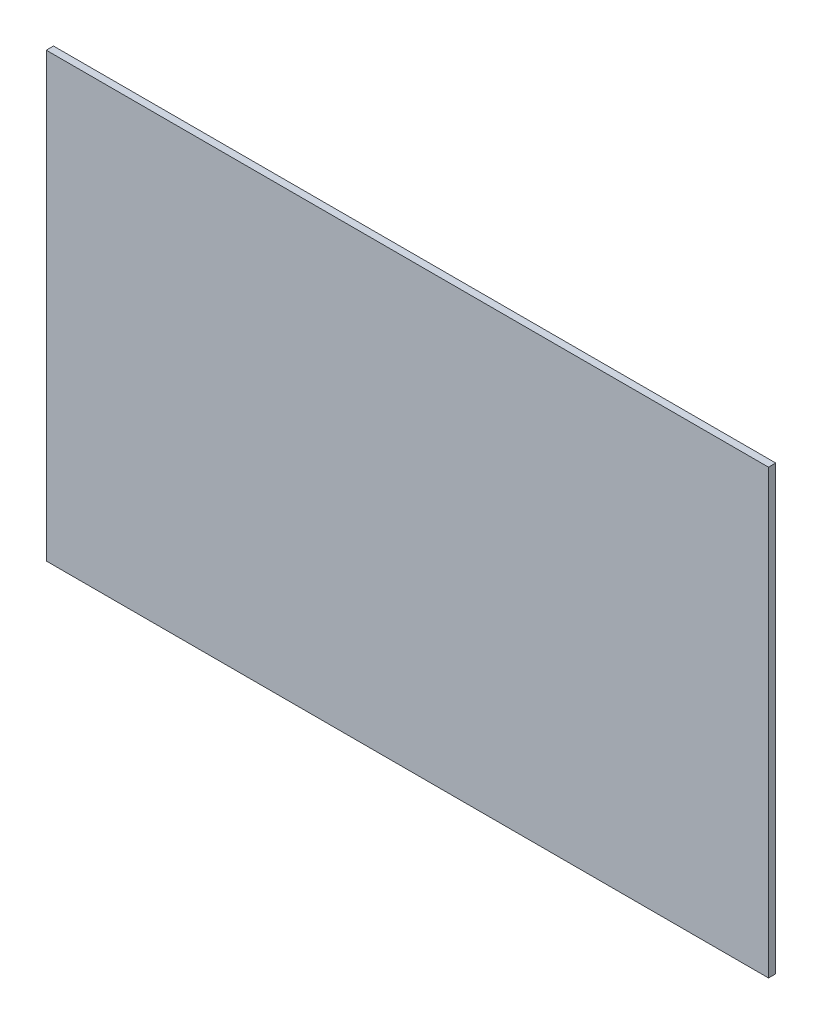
ISO-10303-21;
HEADER;
FILE_DESCRIPTION(('STEP AP214'),'2;1');
FILE_NAME('part.step','',(''),(''),'','','');
FILE_SCHEMA(('AUTOMOTIVE_DESIGN { 1 0 10303 214 1 1 1 1 }'));
ENDSEC;
DATA;
#1=APPLICATION_CONTEXT('core data for automotive mechanical design processes');
#2=APPLICATION_PROTOCOL_DEFINITION('international standard','automotive_design',2000,#1);
#3=PRODUCT_CONTEXT('',#1,'mechanical');
#4=PRODUCT('Part','Part','',(#3));
#5=PRODUCT_RELATED_PRODUCT_CATEGORY('part','',(#4));
#6=PRODUCT_DEFINITION_FORMATION('','',#4);
#7=PRODUCT_DEFINITION_CONTEXT('part definition',#1,'design');
#8=PRODUCT_DEFINITION('design','',#6,#7);
#9=PRODUCT_DEFINITION_SHAPE('','',#8);
#10=(LENGTH_UNIT() NAMED_UNIT(*) SI_UNIT(.MILLI.,.METRE.));
#11=(NAMED_UNIT(*) PLANE_ANGLE_UNIT() SI_UNIT($,.RADIAN.));
#12=(NAMED_UNIT(*) SI_UNIT($,.STERADIAN.) SOLID_ANGLE_UNIT());
#13=UNCERTAINTY_MEASURE_WITH_UNIT(LENGTH_MEASURE(1.E-05),#10,'distance_accuracy_value','');
#14=(GEOMETRIC_REPRESENTATION_CONTEXT(3) GLOBAL_UNCERTAINTY_ASSIGNED_CONTEXT((#13)) GLOBAL_UNIT_ASSIGNED_CONTEXT((#10,
#11,#12)) REPRESENTATION_CONTEXT('',''));
#15=CARTESIAN_POINT('',(0.,0.,0.));
#16=DIRECTION('',(0.,0.,1.));
#17=DIRECTION('',(1.,0.,0.));
#18=AXIS2_PLACEMENT_3D('',#15,#16,#17);
#19=CARTESIAN_POINT('',(-60.,36.75,1.2));
#20=DIRECTION('',(1.,0.,0.));
#21=DIRECTION('',(0.,1.,0.));
#22=AXIS2_PLACEMENT_3D('',#19,#20,#21);
#23=PLANE('',#22);
#24=DIRECTION('',(0.,-1.,0.));
#25=VECTOR('',#24,1.);
#26=CARTESIAN_POINT('',(-60.,36.75,0.));
#27=LINE('',#26,#25);
#28=CARTESIAN_POINT('',(-60.,36.75,0.));
#29=VERTEX_POINT('',#28);
#30=CARTESIAN_POINT('',(-60.,-36.75,0.));
#31=VERTEX_POINT('',#30);
#32=EDGE_CURVE('E98',#29,#31,#27,.T.);
#33=ORIENTED_EDGE('',*,*,#32,.T.);
#34=DIRECTION('',(0.,0.,-1.));
#35=VECTOR('',#34,1.);
#36=CARTESIAN_POINT('',(-60.,-36.75,1.2));
#37=LINE('',#36,#35);
#38=CARTESIAN_POINT('',(-60.,-36.75,1.2));
#39=VERTEX_POINT('',#38);
#40=EDGE_CURVE('E11',#39,#31,#37,.T.);
#41=ORIENTED_EDGE('',*,*,#40,.F.);
#42=DIRECTION('',(0.,-1.,0.));
#43=VECTOR('',#42,1.);
#44=CARTESIAN_POINT('',(-60.,36.75,1.2));
#45=LINE('',#44,#43);
#46=CARTESIAN_POINT('',(-60.,36.75,1.2));
#47=VERTEX_POINT('',#46);
#48=EDGE_CURVE('E86',#47,#39,#45,.T.);
#49=ORIENTED_EDGE('',*,*,#48,.F.);
#50=DIRECTION('',(0.,0.,-1.));
#51=VECTOR('',#50,1.);
#52=CARTESIAN_POINT('',(-60.,36.75,1.2));
#53=LINE('',#52,#51);
#54=EDGE_CURVE('E94',#47,#29,#53,.T.);
#55=ORIENTED_EDGE('',*,*,#54,.T.);
#56=EDGE_LOOP('',(#33,#41,#49,#55));
#57=FACE_BOUND('',#56,.T.);
#58=ADVANCED_FACE('F35',(#57),#23,.F.);
#59=CARTESIAN_POINT('',(-60.,-36.75,1.2));
#60=DIRECTION('',(0.,1.,0.));
#61=DIRECTION('',(-1.,0.,0.));
#62=AXIS2_PLACEMENT_3D('',#59,#60,#61);
#63=PLANE('',#62);
#64=DIRECTION('',(1.,0.,0.));
#65=VECTOR('',#64,1.);
#66=CARTESIAN_POINT('',(-60.,-36.75,0.));
#67=LINE('',#66,#65);
#68=CARTESIAN_POINT('',(60.,-36.75,0.));
#69=VERTEX_POINT('',#68);
#70=EDGE_CURVE('E90',#31,#69,#67,.T.);
#71=ORIENTED_EDGE('',*,*,#70,.T.);
#72=DIRECTION('',(0.,0.,-1.));
#73=VECTOR('',#72,1.);
#74=CARTESIAN_POINT('',(60.,-36.75,1.2));
#75=LINE('',#74,#73);
#76=CARTESIAN_POINT('',(60.,-36.75,1.2));
#77=VERTEX_POINT('',#76);
#78=EDGE_CURVE('E43',#77,#69,#75,.T.);
#79=ORIENTED_EDGE('',*,*,#78,.F.);
#80=DIRECTION('',(1.,0.,0.));
#81=VECTOR('',#80,1.);
#82=CARTESIAN_POINT('',(-60.,-36.75,1.2));
#83=LINE('',#82,#81);
#84=EDGE_CURVE('E81',#39,#77,#83,.T.);
#85=ORIENTED_EDGE('',*,*,#84,.F.);
#86=ORIENTED_EDGE('',*,*,#40,.T.);
#87=EDGE_LOOP('',(#71,#79,#85,#86));
#88=FACE_BOUND('',#87,.T.);
#89=ADVANCED_FACE('F89',(#88),#63,.F.);
#90=CARTESIAN_POINT('',(60.,36.75,1.2));
#91=DIRECTION('',(-1.,0.,0.));
#92=DIRECTION('',(0.,-1.,0.));
#93=AXIS2_PLACEMENT_3D('',#90,#91,#92);
#94=PLANE('',#93);
#95=DIRECTION('',(0.,1.,0.));
#96=VECTOR('',#95,1.);
#97=CARTESIAN_POINT('',(60.,36.75,0.));
#98=LINE('',#97,#96);
#99=CARTESIAN_POINT('',(60.,36.75,0.));
#100=VERTEX_POINT('',#99);
#101=EDGE_CURVE('E68',#69,#100,#98,.T.);
#102=ORIENTED_EDGE('',*,*,#101,.T.);
#103=DIRECTION('',(0.,0.,-1.));
#104=VECTOR('',#103,1.);
#105=CARTESIAN_POINT('',(60.,36.75,1.2));
#106=LINE('',#105,#104);
#107=CARTESIAN_POINT('',(60.,36.75,1.2));
#108=VERTEX_POINT('',#107);
#109=EDGE_CURVE('E91',#108,#100,#106,.T.);
#110=ORIENTED_EDGE('',*,*,#109,.F.);
#111=DIRECTION('',(0.,1.,0.));
#112=VECTOR('',#111,1.);
#113=CARTESIAN_POINT('',(60.,36.75,1.2));
#114=LINE('',#113,#112);
#115=EDGE_CURVE('E84',#77,#108,#114,.T.);
#116=ORIENTED_EDGE('',*,*,#115,.F.);
#117=ORIENTED_EDGE('',*,*,#78,.T.);
#118=EDGE_LOOP('',(#102,#110,#116,#117));
#119=FACE_BOUND('',#118,.T.);
#120=ADVANCED_FACE('F92',(#119),#94,.F.);
#121=CARTESIAN_POINT('',(-60.,36.75,1.2));
#122=DIRECTION('',(0.,-1.,0.));
#123=DIRECTION('',(0.,0.,-1.));
#124=AXIS2_PLACEMENT_3D('',#121,#122,#123);
#125=PLANE('',#124);
#126=DIRECTION('',(-1.,0.,0.));
#127=VECTOR('',#126,1.);
#128=CARTESIAN_POINT('',(-60.,36.75,0.));
#129=LINE('',#128,#127);
#130=EDGE_CURVE('E74',#100,#29,#129,.T.);
#131=ORIENTED_EDGE('',*,*,#130,.T.);
#132=ORIENTED_EDGE('',*,*,#54,.F.);
#133=DIRECTION('',(-1.,0.,0.));
#134=VECTOR('',#133,1.);
#135=CARTESIAN_POINT('',(-60.,36.75,1.2));
#136=LINE('',#135,#134);
#137=EDGE_CURVE('E51',#108,#47,#136,.T.);
#138=ORIENTED_EDGE('',*,*,#137,.F.);
#139=ORIENTED_EDGE('',*,*,#109,.T.);
#140=EDGE_LOOP('',(#131,#132,#138,#139));
#141=FACE_BOUND('',#140,.T.);
#142=ADVANCED_FACE('F105',(#141),#125,.F.);
#143=CARTESIAN_POINT('',(0.,0.,1.2));
#144=DIRECTION('',(0.,0.,1.));
#145=DIRECTION('',(1.,0.,0.));
#146=AXIS2_PLACEMENT_3D('',#143,#144,#145);
#147=PLANE('',#146);
#148=ORIENTED_EDGE('',*,*,#48,.T.);
#149=ORIENTED_EDGE('',*,*,#84,.T.);
#150=ORIENTED_EDGE('',*,*,#115,.T.);
#151=ORIENTED_EDGE('',*,*,#137,.T.);
#152=EDGE_LOOP('',(#148,#149,#150,#151));
#153=FACE_BOUND('',#152,.T.);
#154=ADVANCED_FACE('F82',(#153),#147,.T.);
#155=CARTESIAN_POINT('',(0.,0.,0.));
#156=DIRECTION('',(0.,0.,1.));
#157=DIRECTION('',(1.,0.,0.));
#158=AXIS2_PLACEMENT_3D('',#155,#156,#157);
#159=PLANE('',#158);
#160=ORIENTED_EDGE('',*,*,#32,.F.);
#161=ORIENTED_EDGE('',*,*,#130,.F.);
#162=ORIENTED_EDGE('',*,*,#101,.F.);
#163=ORIENTED_EDGE('',*,*,#70,.F.);
#164=EDGE_LOOP('',(#160,#161,#162,#163));
#165=FACE_BOUND('',#164,.T.);
#166=ADVANCED_FACE('F108',(#165),#159,.F.);
#167=CLOSED_SHELL('',(#58,#89,#120,#142,#154,#166));
#168=MANIFOLD_SOLID_BREP('B2',#167);
#169=ADVANCED_BREP_SHAPE_REPRESENTATION('',(#18,#168),#14);
#170=SHAPE_DEFINITION_REPRESENTATION(#9,#169);
ENDSEC;
END-ISO-10303-21;
